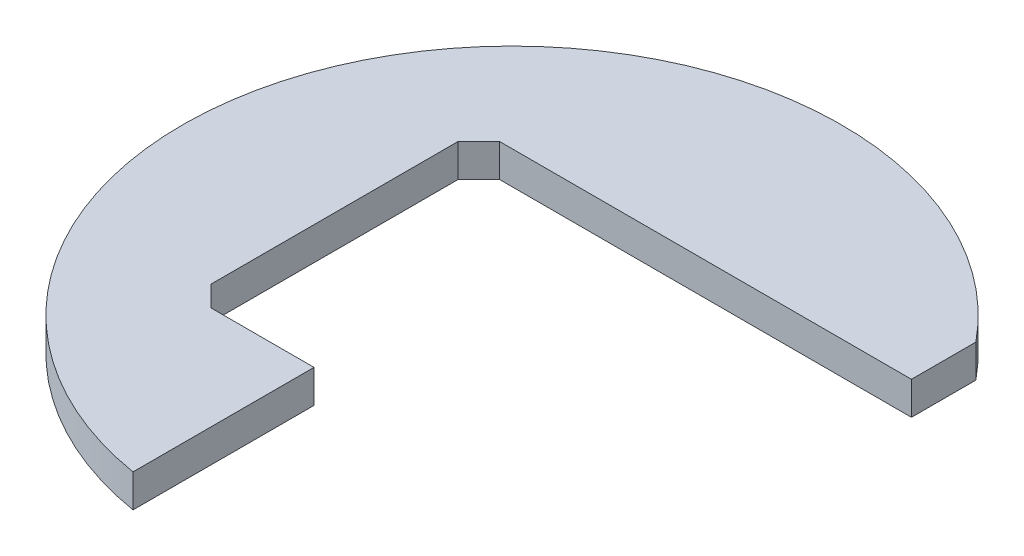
ISO-10303-21;
HEADER;
FILE_DESCRIPTION(('STEP AP214'),'2;1');
FILE_NAME('part.step','',(''),(''),'','','');
FILE_SCHEMA(('AUTOMOTIVE_DESIGN { 1 0 10303 214 1 1 1 1 }'));
ENDSEC;
DATA;
#1=APPLICATION_CONTEXT('core data for automotive mechanical design processes');
#2=APPLICATION_PROTOCOL_DEFINITION('international standard','automotive_design',2000,#1);
#3=PRODUCT_CONTEXT('',#1,'mechanical');
#4=PRODUCT('Part','Part','',(#3));
#5=PRODUCT_RELATED_PRODUCT_CATEGORY('part','',(#4));
#6=PRODUCT_DEFINITION_FORMATION('','',#4);
#7=PRODUCT_DEFINITION_CONTEXT('part definition',#1,'design');
#8=PRODUCT_DEFINITION('design','',#6,#7);
#9=PRODUCT_DEFINITION_SHAPE('','',#8);
#10=(LENGTH_UNIT() NAMED_UNIT(*) SI_UNIT(.MILLI.,.METRE.));
#11=(NAMED_UNIT(*) PLANE_ANGLE_UNIT() SI_UNIT($,.RADIAN.));
#12=(NAMED_UNIT(*) SI_UNIT($,.STERADIAN.) SOLID_ANGLE_UNIT());
#13=UNCERTAINTY_MEASURE_WITH_UNIT(LENGTH_MEASURE(1.E-05),#10,'distance_accuracy_value','');
#14=(GEOMETRIC_REPRESENTATION_CONTEXT(3) GLOBAL_UNCERTAINTY_ASSIGNED_CONTEXT((#13)) GLOBAL_UNIT_ASSIGNED_CONTEXT((#10,
#11,#12)) REPRESENTATION_CONTEXT('',''));
#15=CARTESIAN_POINT('',(0.,0.,0.));
#16=DIRECTION('',(0.,0.,1.));
#17=DIRECTION('',(1.,0.,0.));
#18=AXIS2_PLACEMENT_3D('',#15,#16,#17);
#19=CARTESIAN_POINT('',(0.,1.6,0.));
#20=DIRECTION('',(0.,-1.,0.));
#21=DIRECTION('',(0.,0.,-1.));
#22=AXIS2_PLACEMENT_3D('',#19,#20,#21);
#23=CYLINDRICAL_SURFACE('',#22,16.);
#24=CARTESIAN_POINT('',(0.,0.,0.));
#25=DIRECTION('',(0.,1.,0.));
#26=DIRECTION('',(0.,0.,1.));
#27=AXIS2_PLACEMENT_3D('',#24,#25,#26);
#28=CIRCLE('',#27,16.);
#29=CARTESIAN_POINT('',(12.3874945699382,0.,-10.1266963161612));
#30=VERTEX_POINT('',#29);
#31=CARTESIAN_POINT('',(-2.61250543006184,0.,15.7852721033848));
#32=VERTEX_POINT('',#31);
#33=EDGE_CURVE('E133',#30,#32,#28,.T.);
#34=ORIENTED_EDGE('',*,*,#33,.T.);
#35=DIRECTION('',(0.,-1.,0.));
#36=VECTOR('',#35,1.);
#37=CARTESIAN_POINT('',(-2.61250543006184,1.6,15.7852721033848));
#38=LINE('',#37,#36);
#39=CARTESIAN_POINT('',(-2.61250543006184,1.6,15.7852721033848));
#40=VERTEX_POINT('',#39);
#41=EDGE_CURVE('E11',#40,#32,#38,.T.);
#42=ORIENTED_EDGE('',*,*,#41,.F.);
#43=CARTESIAN_POINT('',(0.,1.6,0.));
#44=DIRECTION('',(0.,1.,0.));
#45=DIRECTION('',(0.,0.,1.));
#46=AXIS2_PLACEMENT_3D('',#43,#44,#45);
#47=CIRCLE('',#46,16.);
#48=CARTESIAN_POINT('',(12.3874945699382,1.6,-10.1266963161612));
#49=VERTEX_POINT('',#48);
#50=EDGE_CURVE('E147',#49,#40,#47,.T.);
#51=ORIENTED_EDGE('',*,*,#50,.F.);
#52=DIRECTION('',(0.,-1.,0.));
#53=VECTOR('',#52,1.);
#54=CARTESIAN_POINT('',(12.3874945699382,1.6,-10.1266963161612));
#55=LINE('',#54,#53);
#56=EDGE_CURVE('E129',#49,#30,#55,.T.);
#57=ORIENTED_EDGE('',*,*,#56,.T.);
#58=EDGE_LOOP('',(#34,#42,#51,#57));
#59=FACE_BOUND('',#58,.T.);
#60=ADVANCED_FACE('F37',(#59),#23,.T.);
#61=CARTESIAN_POINT('',(-2.61250543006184,1.6,7.));
#62=DIRECTION('',(-1.,0.,0.));
#63=DIRECTION('',(0.,0.,1.));
#64=AXIS2_PLACEMENT_3D('',#61,#62,#63);
#65=PLANE('',#64);
#66=DIRECTION('',(0.,0.,-1.));
#67=VECTOR('',#66,1.);
#68=CARTESIAN_POINT('',(-2.61250543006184,0.,7.));
#69=LINE('',#68,#67);
#70=CARTESIAN_POINT('',(-2.61250543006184,0.,7.));
#71=VERTEX_POINT('',#70);
#72=EDGE_CURVE('E136',#32,#71,#69,.T.);
#73=ORIENTED_EDGE('',*,*,#72,.T.);
#74=DIRECTION('',(0.,-1.,0.));
#75=VECTOR('',#74,1.);
#76=CARTESIAN_POINT('',(-2.61250543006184,1.6,7.));
#77=LINE('',#76,#75);
#78=CARTESIAN_POINT('',(-2.61250543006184,1.6,7.));
#79=VERTEX_POINT('',#78);
#80=EDGE_CURVE('E45',#79,#71,#77,.T.);
#81=ORIENTED_EDGE('',*,*,#80,.F.);
#82=DIRECTION('',(0.,0.,-1.));
#83=VECTOR('',#82,1.);
#84=CARTESIAN_POINT('',(-2.61250543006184,1.6,7.));
#85=LINE('',#84,#83);
#86=EDGE_CURVE('E96',#40,#79,#85,.T.);
#87=ORIENTED_EDGE('',*,*,#86,.F.);
#88=ORIENTED_EDGE('',*,*,#41,.T.);
#89=EDGE_LOOP('',(#73,#81,#87,#88));
#90=FACE_BOUND('',#89,.T.);
#91=ADVANCED_FACE('F182',(#90),#65,.F.);
#92=CARTESIAN_POINT('',(-2.61250543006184,1.6,7.));
#93=DIRECTION('',(0.,0.,1.));
#94=DIRECTION('',(1.,0.,0.));
#95=AXIS2_PLACEMENT_3D('',#92,#93,#94);
#96=PLANE('',#95);
#97=DIRECTION('',(-1.,0.,0.));
#98=VECTOR('',#97,1.);
#99=CARTESIAN_POINT('',(-2.61250543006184,0.,7.));
#100=LINE('',#99,#98);
#101=CARTESIAN_POINT('',(-7.61250543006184,0.,7.));
#102=VERTEX_POINT('',#101);
#103=EDGE_CURVE('E138',#71,#102,#100,.T.);
#104=ORIENTED_EDGE('',*,*,#103,.T.);
#105=DIRECTION('',(0.,-1.,0.));
#106=VECTOR('',#105,1.);
#107=CARTESIAN_POINT('',(-7.61250543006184,1.6,7.));
#108=LINE('',#107,#106);
#109=CARTESIAN_POINT('',(-7.61250543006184,1.6,7.));
#110=VERTEX_POINT('',#109);
#111=EDGE_CURVE('E154',#110,#102,#108,.T.);
#112=ORIENTED_EDGE('',*,*,#111,.F.);
#113=DIRECTION('',(-1.,0.,0.));
#114=VECTOR('',#113,1.);
#115=CARTESIAN_POINT('',(-2.61250543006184,1.6,7.));
#116=LINE('',#115,#114);
#117=EDGE_CURVE('E162',#79,#110,#116,.T.);
#118=ORIENTED_EDGE('',*,*,#117,.F.);
#119=ORIENTED_EDGE('',*,*,#80,.T.);
#120=EDGE_LOOP('',(#104,#112,#118,#119));
#121=FACE_BOUND('',#120,.T.);
#122=ADVANCED_FACE('F160',(#121),#96,.F.);
#123=CARTESIAN_POINT('',(-7.61250543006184,1.6,7.));
#124=DIRECTION('',(-0.707106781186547,0.,0.707106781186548));
#125=DIRECTION('',(0.707106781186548,0.,0.707106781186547));
#126=AXIS2_PLACEMENT_3D('',#123,#124,#125);
#127=PLANE('',#126);
#128=DIRECTION('',(-0.707106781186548,0.,-0.707106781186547));
#129=VECTOR('',#128,1.);
#130=CARTESIAN_POINT('',(-7.61250543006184,0.,7.));
#131=LINE('',#130,#129);
#132=CARTESIAN_POINT('',(-8.61250543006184,0.,6.));
#133=VERTEX_POINT('',#132);
#134=EDGE_CURVE('E140',#102,#133,#131,.T.);
#135=ORIENTED_EDGE('',*,*,#134,.T.);
#136=DIRECTION('',(0.,-1.,0.));
#137=VECTOR('',#136,1.);
#138=CARTESIAN_POINT('',(-8.61250543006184,1.6,6.));
#139=LINE('',#138,#137);
#140=CARTESIAN_POINT('',(-8.61250543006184,1.6,6.));
#141=VERTEX_POINT('',#140);
#142=EDGE_CURVE('E151',#141,#133,#139,.T.);
#143=ORIENTED_EDGE('',*,*,#142,.F.);
#144=DIRECTION('',(-0.707106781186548,0.,-0.707106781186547));
#145=VECTOR('',#144,1.);
#146=CARTESIAN_POINT('',(-7.61250543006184,1.6,7.));
#147=LINE('',#146,#145);
#148=EDGE_CURVE('E174',#110,#141,#147,.T.);
#149=ORIENTED_EDGE('',*,*,#148,.F.);
#150=ORIENTED_EDGE('',*,*,#111,.T.);
#151=EDGE_LOOP('',(#135,#143,#149,#150));
#152=FACE_BOUND('',#151,.T.);
#153=ADVANCED_FACE('F170',(#152),#127,.F.);
#154=CARTESIAN_POINT('',(-8.61250543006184,1.6,-6.));
#155=DIRECTION('',(-1.,0.,0.));
#156=DIRECTION('',(0.,0.,1.));
#157=AXIS2_PLACEMENT_3D('',#154,#155,#156);
#158=PLANE('',#157);
#159=DIRECTION('',(0.,0.,-1.));
#160=VECTOR('',#159,1.);
#161=CARTESIAN_POINT('',(-8.61250543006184,0.,-6.));
#162=LINE('',#161,#160);
#163=CARTESIAN_POINT('',(-8.61250543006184,0.,-6.));
#164=VERTEX_POINT('',#163);
#165=EDGE_CURVE('E142',#133,#164,#162,.T.);
#166=ORIENTED_EDGE('',*,*,#165,.T.);
#167=DIRECTION('',(0.,-1.,0.));
#168=VECTOR('',#167,1.);
#169=CARTESIAN_POINT('',(-8.61250543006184,1.6,-6.));
#170=LINE('',#169,#168);
#171=CARTESIAN_POINT('',(-8.61250543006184,1.6,-6.));
#172=VERTEX_POINT('',#171);
#173=EDGE_CURVE('E124',#172,#164,#170,.T.);
#174=ORIENTED_EDGE('',*,*,#173,.F.);
#175=DIRECTION('',(0.,0.,-1.));
#176=VECTOR('',#175,1.);
#177=CARTESIAN_POINT('',(-8.61250543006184,1.6,-6.));
#178=LINE('',#177,#176);
#179=EDGE_CURVE('E115',#141,#172,#178,.T.);
#180=ORIENTED_EDGE('',*,*,#179,.F.);
#181=ORIENTED_EDGE('',*,*,#142,.T.);
#182=EDGE_LOOP('',(#166,#174,#180,#181));
#183=FACE_BOUND('',#182,.T.);
#184=ADVANCED_FACE('F173',(#183),#158,.F.);
#185=CARTESIAN_POINT('',(-7.61250543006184,1.6,-6.99999999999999));
#186=DIRECTION('',(-0.707106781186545,0.,-0.70710678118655));
#187=DIRECTION('',(-0.70710678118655,0.,0.707106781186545));
#188=AXIS2_PLACEMENT_3D('',#185,#186,#187);
#189=PLANE('',#188);
#190=DIRECTION('',(0.70710678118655,0.,-0.707106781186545));
#191=VECTOR('',#190,1.);
#192=CARTESIAN_POINT('',(-7.61250543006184,0.,-6.99999999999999));
#193=LINE('',#192,#191);
#194=CARTESIAN_POINT('',(-7.61250543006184,0.,-6.99999999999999));
#195=VERTEX_POINT('',#194);
#196=EDGE_CURVE('E123',#164,#195,#193,.T.);
#197=ORIENTED_EDGE('',*,*,#196,.T.);
#198=DIRECTION('',(0.,-1.,0.));
#199=VECTOR('',#198,1.);
#200=CARTESIAN_POINT('',(-7.61250543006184,1.6,-6.99999999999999));
#201=LINE('',#200,#199);
#202=CARTESIAN_POINT('',(-7.61250543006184,1.6,-6.99999999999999));
#203=VERTEX_POINT('',#202);
#204=EDGE_CURVE('E120',#203,#195,#201,.T.);
#205=ORIENTED_EDGE('',*,*,#204,.F.);
#206=DIRECTION('',(0.70710678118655,0.,-0.707106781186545));
#207=VECTOR('',#206,1.);
#208=CARTESIAN_POINT('',(-7.61250543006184,1.6,-6.99999999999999));
#209=LINE('',#208,#207);
#210=EDGE_CURVE('E109',#172,#203,#209,.T.);
#211=ORIENTED_EDGE('',*,*,#210,.F.);
#212=ORIENTED_EDGE('',*,*,#173,.T.);
#213=EDGE_LOOP('',(#197,#205,#211,#212));
#214=FACE_BOUND('',#213,.T.);
#215=ADVANCED_FACE('F121',(#214),#189,.F.);
#216=CARTESIAN_POINT('',(12.3874945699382,1.6,-7.));
#217=DIRECTION('',(0.,0.,-1.));
#218=DIRECTION('',(-1.,0.,0.));
#219=AXIS2_PLACEMENT_3D('',#216,#217,#218);
#220=PLANE('',#219);
#221=DIRECTION('',(1.,0.,0.));
#222=VECTOR('',#221,1.);
#223=CARTESIAN_POINT('',(12.3874945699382,0.,-7.));
#224=LINE('',#223,#222);
#225=CARTESIAN_POINT('',(12.3874945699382,0.,-7.));
#226=VERTEX_POINT('',#225);
#227=EDGE_CURVE('E82',#195,#226,#224,.T.);
#228=ORIENTED_EDGE('',*,*,#227,.T.);
#229=DIRECTION('',(0.,-1.,0.));
#230=VECTOR('',#229,1.);
#231=CARTESIAN_POINT('',(12.3874945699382,1.6,-7.));
#232=LINE('',#231,#230);
#233=CARTESIAN_POINT('',(12.3874945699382,1.6,-7.));
#234=VERTEX_POINT('',#233);
#235=EDGE_CURVE('E125',#234,#226,#232,.T.);
#236=ORIENTED_EDGE('',*,*,#235,.F.);
#237=DIRECTION('',(1.,0.,0.));
#238=VECTOR('',#237,1.);
#239=CARTESIAN_POINT('',(12.3874945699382,1.6,-7.));
#240=LINE('',#239,#238);
#241=EDGE_CURVE('E113',#203,#234,#240,.T.);
#242=ORIENTED_EDGE('',*,*,#241,.F.);
#243=ORIENTED_EDGE('',*,*,#204,.T.);
#244=EDGE_LOOP('',(#228,#236,#242,#243));
#245=FACE_BOUND('',#244,.T.);
#246=ADVANCED_FACE('F127',(#245),#220,.F.);
#247=CARTESIAN_POINT('',(12.3874945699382,1.6,-10.1266963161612));
#248=DIRECTION('',(-1.,0.,0.));
#249=DIRECTION('',(0.,0.,1.));
#250=AXIS2_PLACEMENT_3D('',#247,#248,#249);
#251=PLANE('',#250);
#252=DIRECTION('',(0.,0.,-1.));
#253=VECTOR('',#252,1.);
#254=CARTESIAN_POINT('',(12.3874945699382,0.,-10.1266963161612));
#255=LINE('',#254,#253);
#256=EDGE_CURVE('E88',#226,#30,#255,.T.);
#257=ORIENTED_EDGE('',*,*,#256,.T.);
#258=ORIENTED_EDGE('',*,*,#56,.F.);
#259=DIRECTION('',(0.,0.,-1.));
#260=VECTOR('',#259,1.);
#261=CARTESIAN_POINT('',(12.3874945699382,1.6,-10.1266963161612));
#262=LINE('',#261,#260);
#263=EDGE_CURVE('E53',#234,#49,#262,.T.);
#264=ORIENTED_EDGE('',*,*,#263,.F.);
#265=ORIENTED_EDGE('',*,*,#235,.T.);
#266=EDGE_LOOP('',(#257,#258,#264,#265));
#267=FACE_BOUND('',#266,.T.);
#268=ADVANCED_FACE('F198',(#267),#251,.F.);
#269=CARTESIAN_POINT('',(0.,1.6,0.));
#270=DIRECTION('',(0.,1.,0.));
#271=DIRECTION('',(0.,0.,1.));
#272=AXIS2_PLACEMENT_3D('',#269,#270,#271);
#273=PLANE('',#272);
#274=ORIENTED_EDGE('',*,*,#50,.T.);
#275=ORIENTED_EDGE('',*,*,#86,.T.);
#276=ORIENTED_EDGE('',*,*,#117,.T.);
#277=ORIENTED_EDGE('',*,*,#148,.T.);
#278=ORIENTED_EDGE('',*,*,#179,.T.);
#279=ORIENTED_EDGE('',*,*,#210,.T.);
#280=ORIENTED_EDGE('',*,*,#241,.T.);
#281=ORIENTED_EDGE('',*,*,#263,.T.);
#282=EDGE_LOOP('',(#274,#275,#276,#277,#278,#279,#280,#281));
#283=FACE_BOUND('',#282,.T.);
#284=ADVANCED_FACE('F111',(#283),#273,.T.);
#285=CARTESIAN_POINT('',(0.,0.,0.));
#286=DIRECTION('',(0.,1.,0.));
#287=DIRECTION('',(0.,0.,1.));
#288=AXIS2_PLACEMENT_3D('',#285,#286,#287);
#289=PLANE('',#288);
#290=ORIENTED_EDGE('',*,*,#33,.F.);
#291=ORIENTED_EDGE('',*,*,#256,.F.);
#292=ORIENTED_EDGE('',*,*,#227,.F.);
#293=ORIENTED_EDGE('',*,*,#196,.F.);
#294=ORIENTED_EDGE('',*,*,#165,.F.);
#295=ORIENTED_EDGE('',*,*,#134,.F.);
#296=ORIENTED_EDGE('',*,*,#103,.F.);
#297=ORIENTED_EDGE('',*,*,#72,.F.);
#298=EDGE_LOOP('',(#290,#291,#292,#293,#294,#295,#296,#297));
#299=FACE_BOUND('',#298,.T.);
#300=ADVANCED_FACE('F166',(#299),#289,.F.);
#301=CLOSED_SHELL('',(#60,#91,#122,#153,#184,#215,#246,#268,#284,#300));
#302=MANIFOLD_SOLID_BREP('B2',#301);
#303=ADVANCED_BREP_SHAPE_REPRESENTATION('',(#18,#302),#14);
#304=SHAPE_DEFINITION_REPRESENTATION(#9,#303);
ENDSEC;
END-ISO-10303-21;
